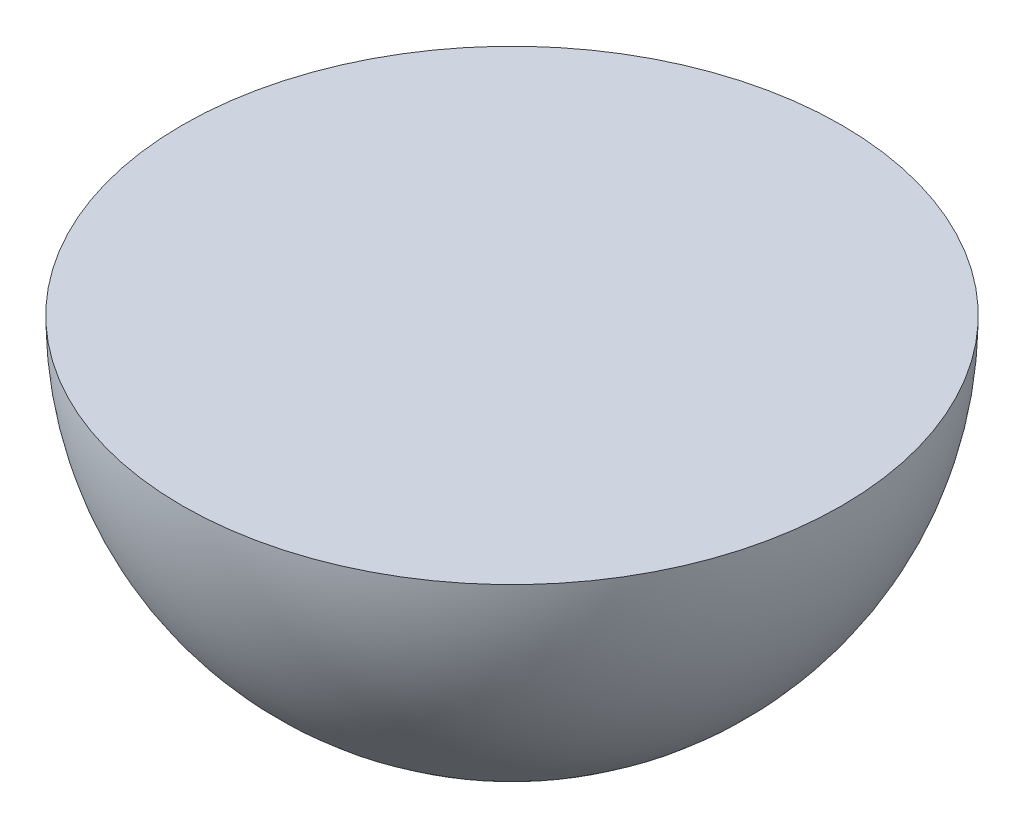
from build123d import *


with BuildPart() as part:
    # Skizze2 → Rotation2 (revolve)
    with BuildSketch(Plane.XY):
        with BuildLine():
            Line((0, -190.7), (0, -189.3))
            Line((0, -189.3), (0, 0))
            Line((0, 0), (-190.7, 0))
            ThreePointArc((-190.7, 0), (-134.845263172, -134.845263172), (0, -190.7))
        make_face()
    revolve(axis=Axis((0, -190, 0), (0, 1, 0)))


solid = part.part
